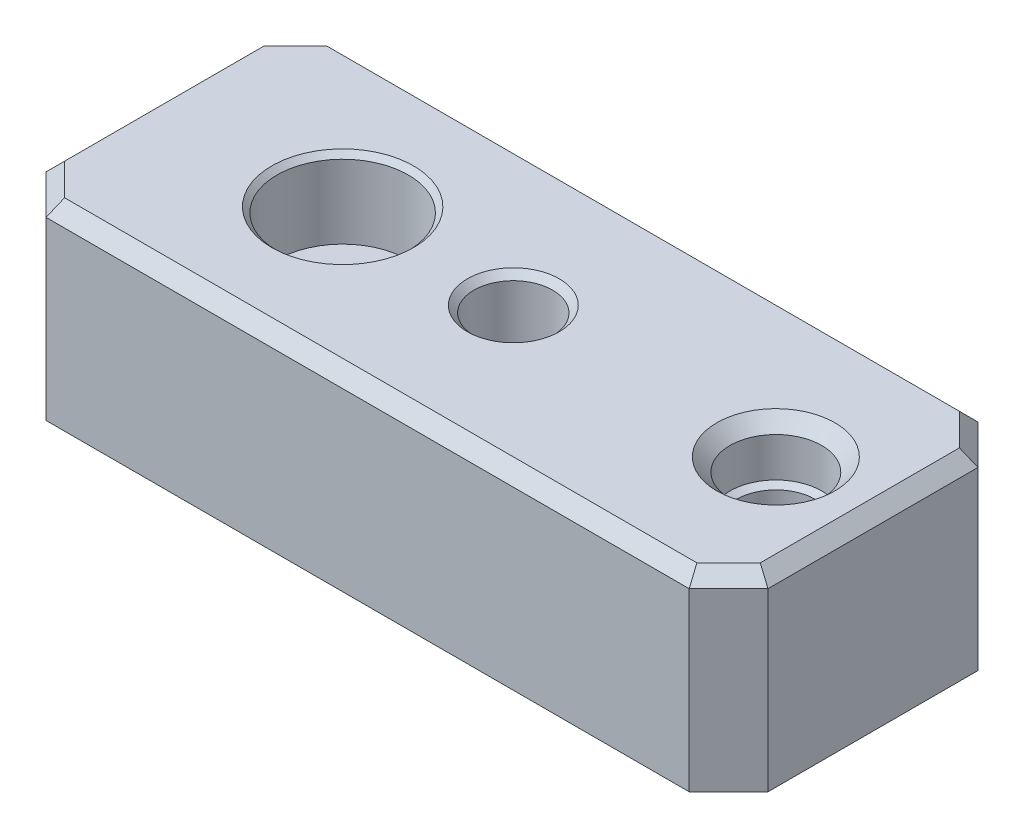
ISO-10303-21;
HEADER;
FILE_DESCRIPTION(('STEP AP214'),'2;1');
FILE_NAME('part.step','',(''),(''),'','','');
FILE_SCHEMA(('AUTOMOTIVE_DESIGN { 1 0 10303 214 1 1 1 1 }'));
ENDSEC;
DATA;
#1=APPLICATION_CONTEXT('core data for automotive mechanical design processes');
#2=APPLICATION_PROTOCOL_DEFINITION('international standard','automotive_design',2000,#1);
#3=PRODUCT_CONTEXT('',#1,'mechanical');
#4=PRODUCT('Part','Part','',(#3));
#5=PRODUCT_RELATED_PRODUCT_CATEGORY('part','',(#4));
#6=PRODUCT_DEFINITION_FORMATION('','',#4);
#7=PRODUCT_DEFINITION_CONTEXT('part definition',#1,'design');
#8=PRODUCT_DEFINITION('design','',#6,#7);
#9=PRODUCT_DEFINITION_SHAPE('','',#8);
#10=(LENGTH_UNIT() NAMED_UNIT(*) SI_UNIT(.MILLI.,.METRE.));
#11=(NAMED_UNIT(*) PLANE_ANGLE_UNIT() SI_UNIT($,.RADIAN.));
#12=(NAMED_UNIT(*) SI_UNIT($,.STERADIAN.) SOLID_ANGLE_UNIT());
#13=UNCERTAINTY_MEASURE_WITH_UNIT(LENGTH_MEASURE(1.E-05),#10,'distance_accuracy_value','');
#14=(GEOMETRIC_REPRESENTATION_CONTEXT(3) GLOBAL_UNCERTAINTY_ASSIGNED_CONTEXT((#13)) GLOBAL_UNIT_ASSIGNED_CONTEXT((#10,
#11,#12)) REPRESENTATION_CONTEXT('',''));
#15=CARTESIAN_POINT('',(0.,0.,0.));
#16=DIRECTION('',(0.,0.,1.));
#17=DIRECTION('',(1.,0.,0.));
#18=AXIS2_PLACEMENT_3D('',#15,#16,#17);
#19=CARTESIAN_POINT('',(13.8,1.7,0.));
#20=DIRECTION('',(0.,-1.,0.));
#21=DIRECTION('',(0.,0.,-1.));
#22=AXIS2_PLACEMENT_3D('',#19,#20,#21);
#23=CONICAL_SURFACE('',#22,1.25,0.785398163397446);
#24=CARTESIAN_POINT('',(13.8,1.2,0.));
#25=DIRECTION('',(0.,1.,0.));
#26=DIRECTION('',(0.,0.,1.));
#27=AXIS2_PLACEMENT_3D('',#24,#25,#26);
#28=CIRCLE('',#27,1.75);
#29=CARTESIAN_POINT('',(13.8,1.2,1.75));
#30=VERTEX_POINT('',#29);
#31=EDGE_CURVE('E204',#30,#30,#28,.T.);
#32=ORIENTED_EDGE('',*,*,#31,.F.);
#33=EDGE_LOOP('',(#32));
#34=FACE_BOUND('',#33,.T.);
#35=CARTESIAN_POINT('',(13.8,1.45,0.));
#36=DIRECTION('',(0.,-1.,0.));
#37=DIRECTION('',(0.,0.,-1.));
#38=AXIS2_PLACEMENT_3D('',#35,#36,#37);
#39=CIRCLE('',#38,1.5);
#40=CARTESIAN_POINT('',(13.8,1.45,-1.5));
#41=VERTEX_POINT('',#40);
#42=EDGE_CURVE('E374',#41,#41,#39,.T.);
#43=ORIENTED_EDGE('',*,*,#42,.F.);
#44=EDGE_LOOP('',(#43));
#45=FACE_BOUND('',#44,.T.);
#46=ADVANCED_FACE('F16',(#34,#45),#23,.F.);
#47=CARTESIAN_POINT('',(13.8,7.2,0.));
#48=DIRECTION('',(0.,1.,0.));
#49=DIRECTION('',(0.,0.,1.));
#50=AXIS2_PLACEMENT_3D('',#47,#48,#49);
#51=CONICAL_SURFACE('',#50,1.75,0.785398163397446);
#52=CARTESIAN_POINT('',(13.8,7.2,0.));
#53=DIRECTION('',(0.,1.,0.));
#54=DIRECTION('',(0.,0.,1.));
#55=AXIS2_PLACEMENT_3D('',#52,#53,#54);
#56=CIRCLE('',#55,1.75);
#57=CARTESIAN_POINT('',(13.8,7.2,1.75));
#58=VERTEX_POINT('',#57);
#59=EDGE_CURVE('E207',#58,#58,#56,.T.);
#60=ORIENTED_EDGE('',*,*,#59,.T.);
#61=EDGE_LOOP('',(#60));
#62=FACE_BOUND('',#61,.T.);
#63=CARTESIAN_POINT('',(13.8,6.95,0.));
#64=DIRECTION('',(0.,1.,0.));
#65=DIRECTION('',(0.,0.,1.));
#66=AXIS2_PLACEMENT_3D('',#63,#64,#65);
#67=CIRCLE('',#66,1.5);
#68=CARTESIAN_POINT('',(13.8,6.95,1.5));
#69=VERTEX_POINT('',#68);
#70=EDGE_CURVE('E21',#69,#69,#67,.T.);
#71=ORIENTED_EDGE('',*,*,#70,.F.);
#72=EDGE_LOOP('',(#71));
#73=FACE_BOUND('',#72,.T.);
#74=ADVANCED_FACE('F385',(#62,#73),#51,.F.);
#75=CARTESIAN_POINT('',(23.8,0.5,0.));
#76=DIRECTION('',(0.,-1.,0.));
#77=DIRECTION('',(0.,0.,-1.));
#78=AXIS2_PLACEMENT_3D('',#75,#76,#77);
#79=CONICAL_SURFACE('',#78,1.25,0.785398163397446);
#80=CARTESIAN_POINT('',(23.8,0.,0.));
#81=DIRECTION('',(0.,1.,0.));
#82=DIRECTION('',(0.,0.,1.));
#83=AXIS2_PLACEMENT_3D('',#80,#81,#82);
#84=CIRCLE('',#83,1.75);
#85=CARTESIAN_POINT('',(23.8,0.,1.75));
#86=VERTEX_POINT('',#85);
#87=EDGE_CURVE('E210',#86,#86,#84,.T.);
#88=ORIENTED_EDGE('',*,*,#87,.F.);
#89=EDGE_LOOP('',(#88));
#90=FACE_BOUND('',#89,.T.);
#91=CARTESIAN_POINT('',(23.8,0.25,0.));
#92=DIRECTION('',(0.,-1.,0.));
#93=DIRECTION('',(0.,0.,-1.));
#94=AXIS2_PLACEMENT_3D('',#91,#92,#93);
#95=CIRCLE('',#94,1.5);
#96=CARTESIAN_POINT('',(23.8,0.25,-1.5));
#97=VERTEX_POINT('',#96);
#98=EDGE_CURVE('E176',#97,#97,#95,.T.);
#99=ORIENTED_EDGE('',*,*,#98,.F.);
#100=EDGE_LOOP('',(#99));
#101=FACE_BOUND('',#100,.T.);
#102=ADVANCED_FACE('F387',(#90,#101),#79,.F.);
#103=CARTESIAN_POINT('',(23.8,5.2,0.));
#104=DIRECTION('',(0.,1.,0.));
#105=DIRECTION('',(0.,0.,1.));
#106=AXIS2_PLACEMENT_3D('',#103,#104,#105);
#107=CONICAL_SURFACE('',#106,1.75,1.02974425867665);
#108=CARTESIAN_POINT('',(23.8,5.2,0.));
#109=DIRECTION('',(0.,1.,0.));
#110=DIRECTION('',(0.,0.,1.));
#111=AXIS2_PLACEMENT_3D('',#108,#109,#110);
#112=CIRCLE('',#111,1.75);
#113=CARTESIAN_POINT('',(23.8,5.2,1.75));
#114=VERTEX_POINT('',#113);
#115=EDGE_CURVE('E201',#114,#114,#112,.T.);
#116=ORIENTED_EDGE('',*,*,#115,.T.);
#117=EDGE_LOOP('',(#116));
#118=FACE_BOUND('',#117,.T.);
#119=CARTESIAN_POINT('',(23.8,5.04978484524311,0.));
#120=DIRECTION('',(0.,1.,0.));
#121=DIRECTION('',(0.,0.,1.));
#122=AXIS2_PLACEMENT_3D('',#119,#120,#121);
#123=CIRCLE('',#122,1.5);
#124=CARTESIAN_POINT('',(23.8,5.04978484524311,1.5));
#125=VERTEX_POINT('',#124);
#126=EDGE_CURVE('E179',#125,#125,#123,.T.);
#127=ORIENTED_EDGE('',*,*,#126,.F.);
#128=EDGE_LOOP('',(#127));
#129=FACE_BOUND('',#128,.T.);
#130=ADVANCED_FACE('F396',(#118,#129),#107,.F.);
#131=CARTESIAN_POINT('',(0.,7.2,-5.5));
#132=DIRECTION('',(1.,0.,0.));
#133=DIRECTION('',(0.,0.,-1.));
#134=AXIS2_PLACEMENT_3D('',#131,#132,#133);
#135=PLANE('',#134);
#136=DIRECTION('',(0.,1.,0.));
#137=VECTOR('',#136,1.);
#138=CARTESIAN_POINT('',(0.,7.2,4.));
#139=LINE('',#138,#137);
#140=CARTESIAN_POINT('',(0.,0.,4.));
#141=VERTEX_POINT('',#140);
#142=CARTESIAN_POINT('',(0.,6.7,4.));
#143=VERTEX_POINT('',#142);
#144=EDGE_CURVE('E306',#141,#143,#139,.T.);
#145=ORIENTED_EDGE('',*,*,#144,.T.);
#146=DIRECTION('',(0.,0.,-1.));
#147=VECTOR('',#146,1.);
#148=CARTESIAN_POINT('',(0.,6.7,-4.));
#149=LINE('',#148,#147);
#150=CARTESIAN_POINT('',(0.,6.7,-4.));
#151=VERTEX_POINT('',#150);
#152=EDGE_CURVE('E341',#143,#151,#149,.T.);
#153=ORIENTED_EDGE('',*,*,#152,.T.);
#154=DIRECTION('',(0.,-1.,0.));
#155=VECTOR('',#154,1.);
#156=CARTESIAN_POINT('',(0.,7.2,-4.));
#157=LINE('',#156,#155);
#158=CARTESIAN_POINT('',(0.,0.,-4.));
#159=VERTEX_POINT('',#158);
#160=EDGE_CURVE('E309',#151,#159,#157,.T.);
#161=ORIENTED_EDGE('',*,*,#160,.T.);
#162=DIRECTION('',(0.,0.,1.));
#163=VECTOR('',#162,1.);
#164=CARTESIAN_POINT('',(0.,0.,-5.5));
#165=LINE('',#164,#163);
#166=CARTESIAN_POINT('',(0.,0.,-3.25));
#167=VERTEX_POINT('',#166);
#168=EDGE_CURVE('E272',#159,#167,#165,.T.);
#169=ORIENTED_EDGE('',*,*,#168,.T.);
#170=DIRECTION('',(0.,-1.,0.));
#171=VECTOR('',#170,1.);
#172=CARTESIAN_POINT('',(0.,1.2,-3.25));
#173=LINE('',#172,#171);
#174=CARTESIAN_POINT('',(0.,1.2,-3.25));
#175=VERTEX_POINT('',#174);
#176=EDGE_CURVE('E254',#175,#167,#173,.T.);
#177=ORIENTED_EDGE('',*,*,#176,.F.);
#178=DIRECTION('',(0.,0.,-1.));
#179=VECTOR('',#178,1.);
#180=CARTESIAN_POINT('',(0.,1.2,3.25));
#181=LINE('',#180,#179);
#182=CARTESIAN_POINT('',(0.,1.2,3.25));
#183=VERTEX_POINT('',#182);
#184=EDGE_CURVE('E241',#183,#175,#181,.T.);
#185=ORIENTED_EDGE('',*,*,#184,.F.);
#186=DIRECTION('',(0.,-1.,0.));
#187=VECTOR('',#186,1.);
#188=CARTESIAN_POINT('',(0.,1.2,3.25));
#189=LINE('',#188,#187);
#190=CARTESIAN_POINT('',(0.,0.,3.25));
#191=VERTEX_POINT('',#190);
#192=EDGE_CURVE('E262',#183,#191,#189,.T.);
#193=ORIENTED_EDGE('',*,*,#192,.T.);
#194=EDGE_CURVE('E265',#191,#141,#165,.T.);
#195=ORIENTED_EDGE('',*,*,#194,.T.);
#196=EDGE_LOOP('',(#145,#153,#161,#169,#177,#185,#193,#195));
#197=FACE_BOUND('',#196,.T.);
#198=ADVANCED_FACE('F472',(#197),#135,.F.);
#199=CARTESIAN_POINT('',(0.,7.2,5.5));
#200=DIRECTION('',(0.,0.,-1.));
#201=DIRECTION('',(-1.,0.,0.));
#202=AXIS2_PLACEMENT_3D('',#199,#200,#201);
#203=PLANE('',#202);
#204=DIRECTION('',(0.,1.,0.));
#205=VECTOR('',#204,1.);
#206=CARTESIAN_POINT('',(26.,7.2,5.5));
#207=LINE('',#206,#205);
#208=CARTESIAN_POINT('',(26.,0.,5.5));
#209=VERTEX_POINT('',#208);
#210=CARTESIAN_POINT('',(26.,6.7,5.5));
#211=VERTEX_POINT('',#210);
#212=EDGE_CURVE('E304',#209,#211,#207,.T.);
#213=ORIENTED_EDGE('',*,*,#212,.T.);
#214=DIRECTION('',(-1.,0.,0.));
#215=VECTOR('',#214,1.);
#216=CARTESIAN_POINT('',(1.5,6.7,5.5));
#217=LINE('',#216,#215);
#218=CARTESIAN_POINT('',(1.5,6.7,5.5));
#219=VERTEX_POINT('',#218);
#220=EDGE_CURVE('E42',#211,#219,#217,.T.);
#221=ORIENTED_EDGE('',*,*,#220,.T.);
#222=DIRECTION('',(0.,-1.,0.));
#223=VECTOR('',#222,1.);
#224=CARTESIAN_POINT('',(1.5,7.2,5.5));
#225=LINE('',#224,#223);
#226=CARTESIAN_POINT('',(1.5,0.,5.5));
#227=VERTEX_POINT('',#226);
#228=EDGE_CURVE('E302',#219,#227,#225,.T.);
#229=ORIENTED_EDGE('',*,*,#228,.T.);
#230=DIRECTION('',(1.,0.,0.));
#231=VECTOR('',#230,1.);
#232=CARTESIAN_POINT('',(0.,0.,5.5));
#233=LINE('',#232,#231);
#234=EDGE_CURVE('E274',#227,#209,#233,.T.);
#235=ORIENTED_EDGE('',*,*,#234,.T.);
#236=EDGE_LOOP('',(#213,#221,#229,#235));
#237=FACE_BOUND('',#236,.T.);
#238=ADVANCED_FACE('F468',(#237),#203,.F.);
#239=CARTESIAN_POINT('',(27.5,7.2,-5.5));
#240=DIRECTION('',(-1.,0.,0.));
#241=DIRECTION('',(0.,0.,1.));
#242=AXIS2_PLACEMENT_3D('',#239,#240,#241);
#243=PLANE('',#242);
#244=DIRECTION('',(0.,1.,0.));
#245=VECTOR('',#244,1.);
#246=CARTESIAN_POINT('',(27.5,7.2,-4.));
#247=LINE('',#246,#245);
#248=CARTESIAN_POINT('',(27.5,0.,-4.));
#249=VERTEX_POINT('',#248);
#250=CARTESIAN_POINT('',(27.5,6.7,-4.));
#251=VERTEX_POINT('',#250);
#252=EDGE_CURVE('E299',#249,#251,#247,.T.);
#253=ORIENTED_EDGE('',*,*,#252,.T.);
#254=DIRECTION('',(0.,0.,1.));
#255=VECTOR('',#254,1.);
#256=CARTESIAN_POINT('',(27.5,6.7,4.));
#257=LINE('',#256,#255);
#258=CARTESIAN_POINT('',(27.5,6.7,4.));
#259=VERTEX_POINT('',#258);
#260=EDGE_CURVE('E332',#251,#259,#257,.T.);
#261=ORIENTED_EDGE('',*,*,#260,.T.);
#262=DIRECTION('',(0.,-1.,0.));
#263=VECTOR('',#262,1.);
#264=CARTESIAN_POINT('',(27.5,7.2,4.));
#265=LINE('',#264,#263);
#266=CARTESIAN_POINT('',(27.5,0.,4.));
#267=VERTEX_POINT('',#266);
#268=EDGE_CURVE('E297',#259,#267,#265,.T.);
#269=ORIENTED_EDGE('',*,*,#268,.T.);
#270=DIRECTION('',(0.,0.,-1.));
#271=VECTOR('',#270,1.);
#272=CARTESIAN_POINT('',(27.5,0.,-5.5));
#273=LINE('',#272,#271);
#274=EDGE_CURVE('E277',#267,#249,#273,.T.);
#275=ORIENTED_EDGE('',*,*,#274,.T.);
#276=EDGE_LOOP('',(#253,#261,#269,#275));
#277=FACE_BOUND('',#276,.T.);
#278=ADVANCED_FACE('F464',(#277),#243,.F.);
#279=CARTESIAN_POINT('',(0.,7.2,-5.5));
#280=DIRECTION('',(0.,0.,1.));
#281=DIRECTION('',(1.,0.,0.));
#282=AXIS2_PLACEMENT_3D('',#279,#280,#281);
#283=PLANE('',#282);
#284=DIRECTION('',(0.,1.,0.));
#285=VECTOR('',#284,1.);
#286=CARTESIAN_POINT('',(1.5,7.2,-5.5));
#287=LINE('',#286,#285);
#288=CARTESIAN_POINT('',(1.5,0.,-5.5));
#289=VERTEX_POINT('',#288);
#290=CARTESIAN_POINT('',(1.5,6.7,-5.5));
#291=VERTEX_POINT('',#290);
#292=EDGE_CURVE('E284',#289,#291,#287,.T.);
#293=ORIENTED_EDGE('',*,*,#292,.T.);
#294=DIRECTION('',(1.,0.,0.));
#295=VECTOR('',#294,1.);
#296=CARTESIAN_POINT('',(26.,6.7,-5.5));
#297=LINE('',#296,#295);
#298=CARTESIAN_POINT('',(26.,6.7,-5.5));
#299=VERTEX_POINT('',#298);
#300=EDGE_CURVE('E336',#291,#299,#297,.T.);
#301=ORIENTED_EDGE('',*,*,#300,.T.);
#302=DIRECTION('',(0.,-1.,0.));
#303=VECTOR('',#302,1.);
#304=CARTESIAN_POINT('',(26.,7.2,-5.5));
#305=LINE('',#304,#303);
#306=CARTESIAN_POINT('',(26.,0.,-5.5));
#307=VERTEX_POINT('',#306);
#308=EDGE_CURVE('E287',#299,#307,#305,.T.);
#309=ORIENTED_EDGE('',*,*,#308,.T.);
#310=DIRECTION('',(-1.,0.,0.));
#311=VECTOR('',#310,1.);
#312=CARTESIAN_POINT('',(0.,0.,-5.5));
#313=LINE('',#312,#311);
#314=EDGE_CURVE('E280',#307,#289,#313,.T.);
#315=ORIENTED_EDGE('',*,*,#314,.T.);
#316=EDGE_LOOP('',(#293,#301,#309,#315));
#317=FACE_BOUND('',#316,.T.);
#318=ADVANCED_FACE('F457',(#317),#283,.F.);
#319=CARTESIAN_POINT('',(0.,7.2,0.));
#320=DIRECTION('',(0.,1.,0.));
#321=DIRECTION('',(0.,0.,1.));
#322=AXIS2_PLACEMENT_3D('',#319,#320,#321);
#323=PLANE('',#322);
#324=DIRECTION('',(0.,0.,-1.));
#325=VECTOR('',#324,1.);
#326=CARTESIAN_POINT('',(27.,7.2,-4.));
#327=LINE('',#326,#325);
#328=CARTESIAN_POINT('',(27.,7.2,3.79289321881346));
#329=VERTEX_POINT('',#328);
#330=CARTESIAN_POINT('',(27.,7.2,-3.79289321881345));
#331=VERTEX_POINT('',#330);
#332=EDGE_CURVE('E324',#329,#331,#327,.T.);
#333=ORIENTED_EDGE('',*,*,#332,.T.);
#334=DIRECTION('',(-0.707106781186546,0.,-0.707106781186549));
#335=VECTOR('',#334,1.);
#336=CARTESIAN_POINT('',(15.3964466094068,7.2,-15.3964466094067));
#337=LINE('',#336,#335);
#338=CARTESIAN_POINT('',(25.7928932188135,7.2,-5.));
#339=VERTEX_POINT('',#338);
#340=EDGE_CURVE('E326',#331,#339,#337,.T.);
#341=ORIENTED_EDGE('',*,*,#340,.T.);
#342=DIRECTION('',(-1.,0.,0.));
#343=VECTOR('',#342,1.);
#344=CARTESIAN_POINT('',(1.5,7.2,-5.));
#345=LINE('',#344,#343);
#346=CARTESIAN_POINT('',(1.70710678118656,7.2,-5.));
#347=VERTEX_POINT('',#346);
#348=EDGE_CURVE('E319',#339,#347,#345,.T.);
#349=ORIENTED_EDGE('',*,*,#348,.T.);
#350=DIRECTION('',(-0.707106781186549,0.,0.707106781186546));
#351=VECTOR('',#350,1.);
#352=CARTESIAN_POINT('',(-1.64644660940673,7.2,-1.64644660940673));
#353=LINE('',#352,#351);
#354=CARTESIAN_POINT('',(0.5,7.2,-3.79289321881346));
#355=VERTEX_POINT('',#354);
#356=EDGE_CURVE('E317',#347,#355,#353,.T.);
#357=ORIENTED_EDGE('',*,*,#356,.T.);
#358=DIRECTION('',(0.,0.,1.));
#359=VECTOR('',#358,1.);
#360=CARTESIAN_POINT('',(0.5,7.2,4.));
#361=LINE('',#360,#359);
#362=CARTESIAN_POINT('',(0.5,7.2,3.79289321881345));
#363=VERTEX_POINT('',#362);
#364=EDGE_CURVE('E315',#355,#363,#361,.T.);
#365=ORIENTED_EDGE('',*,*,#364,.T.);
#366=DIRECTION('',(0.707106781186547,0.,0.707106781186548));
#367=VECTOR('',#366,1.);
#368=CARTESIAN_POINT('',(-1.64644660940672,7.2,1.64644660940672));
#369=LINE('',#368,#367);
#370=CARTESIAN_POINT('',(1.70710678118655,7.2,5.));
#371=VERTEX_POINT('',#370);
#372=EDGE_CURVE('E313',#363,#371,#369,.T.);
#373=ORIENTED_EDGE('',*,*,#372,.T.);
#374=DIRECTION('',(1.,0.,0.));
#375=VECTOR('',#374,1.);
#376=CARTESIAN_POINT('',(26.,7.2,5.));
#377=LINE('',#376,#375);
#378=CARTESIAN_POINT('',(25.7928932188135,7.2,5.));
#379=VERTEX_POINT('',#378);
#380=EDGE_CURVE('E311',#371,#379,#377,.T.);
#381=ORIENTED_EDGE('',*,*,#380,.T.);
#382=DIRECTION('',(0.707106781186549,0.,-0.707106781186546));
#383=VECTOR('',#382,1.);
#384=CARTESIAN_POINT('',(15.3964466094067,7.2,15.3964466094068));
#385=LINE('',#384,#383);
#386=EDGE_CURVE('E322',#379,#329,#385,.T.);
#387=ORIENTED_EDGE('',*,*,#386,.T.);
#388=EDGE_LOOP('',(#333,#341,#349,#357,#365,#373,#381,#387));
#389=FACE_BOUND('',#388,.T.);
#390=CARTESIAN_POINT('',(23.8,7.2,0.));
#391=DIRECTION('',(0.,1.,0.));
#392=DIRECTION('',(0.,0.,1.));
#393=AXIS2_PLACEMENT_3D('',#390,#391,#392);
#394=CIRCLE('',#393,2.25);
#395=CARTESIAN_POINT('',(23.8,7.2,2.25));
#396=VERTEX_POINT('',#395);
#397=EDGE_CURVE('E194',#396,#396,#394,.T.);
#398=ORIENTED_EDGE('',*,*,#397,.F.);
#399=EDGE_LOOP('',(#398));
#400=FACE_BOUND('',#399,.T.);
#401=ORIENTED_EDGE('',*,*,#59,.F.);
#402=EDGE_LOOP('',(#401));
#403=FACE_BOUND('',#402,.T.);
#404=CARTESIAN_POINT('',(7.3,7.2,0.));
#405=DIRECTION('',(0.,1.,0.));
#406=DIRECTION('',(0.,0.,1.));
#407=AXIS2_PLACEMENT_3D('',#404,#405,#406);
#408=CIRCLE('',#407,2.7);
#409=CARTESIAN_POINT('',(7.3,7.2,2.7));
#410=VERTEX_POINT('',#409);
#411=EDGE_CURVE('E216',#410,#410,#408,.T.);
#412=ORIENTED_EDGE('',*,*,#411,.F.);
#413=EDGE_LOOP('',(#412));
#414=FACE_BOUND('',#413,.T.);
#415=ADVANCED_FACE('F454',(#389,#400,#403,#414),#323,.T.);
#416=CARTESIAN_POINT('',(0.,0.,0.));
#417=DIRECTION('',(0.,1.,0.));
#418=DIRECTION('',(0.,0.,1.));
#419=AXIS2_PLACEMENT_3D('',#416,#417,#418);
#420=PLANE('',#419);
#421=ORIENTED_EDGE('',*,*,#87,.T.);
#422=EDGE_LOOP('',(#421));
#423=FACE_BOUND('',#422,.T.);
#424=ORIENTED_EDGE('',*,*,#314,.F.);
#425=DIRECTION('',(-0.707106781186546,0.,-0.707106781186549));
#426=VECTOR('',#425,1.);
#427=CARTESIAN_POINT('',(26.,0.,-5.5));
#428=LINE('',#427,#426);
#429=EDGE_CURVE('E295',#307,#249,#428,.F.);
#430=ORIENTED_EDGE('',*,*,#429,.T.);
#431=ORIENTED_EDGE('',*,*,#274,.F.);
#432=DIRECTION('',(0.707106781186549,0.,-0.707106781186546));
#433=VECTOR('',#432,1.);
#434=CARTESIAN_POINT('',(27.5,0.,4.));
#435=LINE('',#434,#433);
#436=EDGE_CURVE('E293',#267,#209,#435,.F.);
#437=ORIENTED_EDGE('',*,*,#436,.T.);
#438=ORIENTED_EDGE('',*,*,#234,.F.);
#439=DIRECTION('',(0.707106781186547,0.,0.707106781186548));
#440=VECTOR('',#439,1.);
#441=CARTESIAN_POINT('',(1.5,0.,5.5));
#442=LINE('',#441,#440);
#443=EDGE_CURVE('E289',#227,#141,#442,.F.);
#444=ORIENTED_EDGE('',*,*,#443,.T.);
#445=ORIENTED_EDGE('',*,*,#194,.F.);
#446=DIRECTION('',(-1.,0.,0.));
#447=VECTOR('',#446,1.);
#448=CARTESIAN_POINT('',(0.,0.,3.25));
#449=LINE('',#448,#447);
#450=CARTESIAN_POINT('',(13.8,0.,3.25));
#451=VERTEX_POINT('',#450);
#452=EDGE_CURVE('E245',#451,#191,#449,.T.);
#453=ORIENTED_EDGE('',*,*,#452,.F.);
#454=CARTESIAN_POINT('',(13.8,0.,0.));
#455=DIRECTION('',(0.,-1.,0.));
#456=DIRECTION('',(0.,0.,-1.));
#457=AXIS2_PLACEMENT_3D('',#454,#455,#456);
#458=CIRCLE('',#457,3.25);
#459=CARTESIAN_POINT('',(13.8,0.,-3.25));
#460=VERTEX_POINT('',#459);
#461=EDGE_CURVE('E257',#460,#451,#458,.T.);
#462=ORIENTED_EDGE('',*,*,#461,.F.);
#463=DIRECTION('',(1.,0.,0.));
#464=VECTOR('',#463,1.);
#465=CARTESIAN_POINT('',(0.,0.,-3.25));
#466=LINE('',#465,#464);
#467=EDGE_CURVE('E240',#167,#460,#466,.T.);
#468=ORIENTED_EDGE('',*,*,#467,.F.);
#469=ORIENTED_EDGE('',*,*,#168,.F.);
#470=DIRECTION('',(-0.707106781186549,0.,0.707106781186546));
#471=VECTOR('',#470,1.);
#472=CARTESIAN_POINT('',(0.,0.,-4.));
#473=LINE('',#472,#471);
#474=EDGE_CURVE('E291',#159,#289,#473,.F.);
#475=ORIENTED_EDGE('',*,*,#474,.T.);
#476=EDGE_LOOP('',(#424,#430,#431,#437,#438,#444,#445,#453,#462,#468,#469,#475));
#477=FACE_BOUND('',#476,.T.);
#478=ADVANCED_FACE('F446',(#423,#477),#420,.F.);
#479=CARTESIAN_POINT('',(0.,1.2,3.25));
#480=DIRECTION('',(0.,0.,1.));
#481=DIRECTION('',(1.,0.,0.));
#482=AXIS2_PLACEMENT_3D('',#479,#480,#481);
#483=PLANE('',#482);
#484=ORIENTED_EDGE('',*,*,#452,.T.);
#485=ORIENTED_EDGE('',*,*,#192,.F.);
#486=DIRECTION('',(-1.,0.,0.));
#487=VECTOR('',#486,1.);
#488=CARTESIAN_POINT('',(0.,1.2,3.25));
#489=LINE('',#488,#487);
#490=CARTESIAN_POINT('',(13.8,1.2,3.25));
#491=VERTEX_POINT('',#490);
#492=EDGE_CURVE('E251',#491,#183,#489,.T.);
#493=ORIENTED_EDGE('',*,*,#492,.F.);
#494=DIRECTION('',(0.,-1.,0.));
#495=VECTOR('',#494,1.);
#496=CARTESIAN_POINT('',(13.8,1.2,3.25));
#497=LINE('',#496,#495);
#498=EDGE_CURVE('E266',#491,#451,#497,.T.);
#499=ORIENTED_EDGE('',*,*,#498,.T.);
#500=EDGE_LOOP('',(#484,#485,#493,#499));
#501=FACE_BOUND('',#500,.T.);
#502=ADVANCED_FACE('F442',(#501),#483,.F.);
#503=CARTESIAN_POINT('',(13.8,1.2,0.));
#504=DIRECTION('',(0.,-1.,0.));
#505=DIRECTION('',(0.,0.,-1.));
#506=AXIS2_PLACEMENT_3D('',#503,#504,#505);
#507=CYLINDRICAL_SURFACE('',#506,3.25);
#508=ORIENTED_EDGE('',*,*,#461,.T.);
#509=ORIENTED_EDGE('',*,*,#498,.F.);
#510=CARTESIAN_POINT('',(13.8,1.2,0.));
#511=DIRECTION('',(0.,-1.,0.));
#512=DIRECTION('',(0.,0.,-1.));
#513=AXIS2_PLACEMENT_3D('',#510,#511,#512);
#514=CIRCLE('',#513,3.25);
#515=CARTESIAN_POINT('',(13.8,1.2,-3.25));
#516=VERTEX_POINT('',#515);
#517=EDGE_CURVE('E248',#516,#491,#514,.T.);
#518=ORIENTED_EDGE('',*,*,#517,.F.);
#519=DIRECTION('',(0.,-1.,0.));
#520=VECTOR('',#519,1.);
#521=CARTESIAN_POINT('',(13.8,1.2,-3.25));
#522=LINE('',#521,#520);
#523=EDGE_CURVE('E268',#516,#460,#522,.T.);
#524=ORIENTED_EDGE('',*,*,#523,.T.);
#525=EDGE_LOOP('',(#508,#509,#518,#524));
#526=FACE_BOUND('',#525,.T.);
#527=ADVANCED_FACE('F445',(#526),#507,.F.);
#528=CARTESIAN_POINT('',(0.,1.2,-3.25));
#529=DIRECTION('',(0.,0.,-1.));
#530=DIRECTION('',(-1.,0.,0.));
#531=AXIS2_PLACEMENT_3D('',#528,#529,#530);
#532=PLANE('',#531);
#533=ORIENTED_EDGE('',*,*,#467,.T.);
#534=ORIENTED_EDGE('',*,*,#523,.F.);
#535=DIRECTION('',(1.,0.,0.));
#536=VECTOR('',#535,1.);
#537=CARTESIAN_POINT('',(0.,1.2,-3.25));
#538=LINE('',#537,#536);
#539=EDGE_CURVE('E244',#175,#516,#538,.T.);
#540=ORIENTED_EDGE('',*,*,#539,.F.);
#541=ORIENTED_EDGE('',*,*,#176,.T.);
#542=EDGE_LOOP('',(#533,#534,#540,#541));
#543=FACE_BOUND('',#542,.T.);
#544=ADVANCED_FACE('F440',(#543),#532,.F.);
#545=CARTESIAN_POINT('',(13.8,1.2,0.));
#546=DIRECTION('',(0.,-1.,0.));
#547=DIRECTION('',(0.,0.,-1.));
#548=AXIS2_PLACEMENT_3D('',#545,#546,#547);
#549=PLANE('',#548);
#550=ORIENTED_EDGE('',*,*,#31,.T.);
#551=EDGE_LOOP('',(#550));
#552=FACE_BOUND('',#551,.T.);
#553=CARTESIAN_POINT('',(7.3,1.2,0.));
#554=DIRECTION('',(0.,1.,0.));
#555=DIRECTION('',(0.,0.,1.));
#556=AXIS2_PLACEMENT_3D('',#553,#554,#555);
#557=CIRCLE('',#556,1.7);
#558=CARTESIAN_POINT('',(7.3,1.2,1.7));
#559=VERTEX_POINT('',#558);
#560=EDGE_CURVE('E213',#559,#559,#557,.T.);
#561=ORIENTED_EDGE('',*,*,#560,.T.);
#562=EDGE_LOOP('',(#561));
#563=FACE_BOUND('',#562,.T.);
#564=CARTESIAN_POINT('',(2.3,1.2,0.));
#565=DIRECTION('',(0.,-1.,0.));
#566=DIRECTION('',(0.,0.,-1.));
#567=AXIS2_PLACEMENT_3D('',#564,#565,#566);
#568=CIRCLE('',#567,1.7);
#569=CARTESIAN_POINT('',(2.3,1.2,-1.7));
#570=VERTEX_POINT('',#569);
#571=EDGE_CURVE('E231',#570,#570,#568,.T.);
#572=ORIENTED_EDGE('',*,*,#571,.F.);
#573=EDGE_LOOP('',(#572));
#574=FACE_BOUND('',#573,.T.);
#575=ORIENTED_EDGE('',*,*,#184,.T.);
#576=ORIENTED_EDGE('',*,*,#539,.T.);
#577=ORIENTED_EDGE('',*,*,#517,.T.);
#578=ORIENTED_EDGE('',*,*,#492,.T.);
#579=EDGE_LOOP('',(#575,#576,#577,#578));
#580=FACE_BOUND('',#579,.T.);
#581=ADVANCED_FACE('F436',(#552,#563,#574,#580),#549,.T.);
#582=CARTESIAN_POINT('',(2.3,1.7,0.));
#583=DIRECTION('',(0.,1.,0.));
#584=DIRECTION('',(0.,0.,1.));
#585=AXIS2_PLACEMENT_3D('',#582,#583,#584);
#586=PLANE('',#585);
#587=DIRECTION('',(0.,0.,-1.));
#588=VECTOR('',#587,1.);
#589=CARTESIAN_POINT('',(3.3,1.7,0.));
#590=LINE('',#589,#588);
#591=CARTESIAN_POINT('',(3.3,1.7,0.25));
#592=VERTEX_POINT('',#591);
#593=CARTESIAN_POINT('',(3.3,1.7,-0.25));
#594=VERTEX_POINT('',#593);
#595=EDGE_CURVE('E346',#592,#594,#590,.T.);
#596=ORIENTED_EDGE('',*,*,#595,.T.);
#597=CARTESIAN_POINT('',(2.3,1.7,-0.25));
#598=DIRECTION('',(0.,1.,0.));
#599=DIRECTION('',(0.,0.,1.));
#600=AXIS2_PLACEMENT_3D('',#597,#598,#599);
#601=CIRCLE('',#600,1.);
#602=CARTESIAN_POINT('',(1.3,1.7,-0.25));
#603=VERTEX_POINT('',#602);
#604=EDGE_CURVE('E10',#594,#603,#601,.T.);
#605=ORIENTED_EDGE('',*,*,#604,.T.);
#606=DIRECTION('',(0.,0.,1.));
#607=VECTOR('',#606,1.);
#608=CARTESIAN_POINT('',(1.3,1.7,0.));
#609=LINE('',#608,#607);
#610=CARTESIAN_POINT('',(1.3,1.7,0.25));
#611=VERTEX_POINT('',#610);
#612=EDGE_CURVE('E26',#603,#611,#609,.T.);
#613=ORIENTED_EDGE('',*,*,#612,.T.);
#614=CARTESIAN_POINT('',(2.3,1.7,0.25));
#615=DIRECTION('',(0.,1.,0.));
#616=DIRECTION('',(0.,0.,1.));
#617=AXIS2_PLACEMENT_3D('',#614,#615,#616);
#618=CIRCLE('',#617,1.);
#619=EDGE_CURVE('E368',#611,#592,#618,.T.);
#620=ORIENTED_EDGE('',*,*,#619,.T.);
#621=EDGE_LOOP('',(#596,#605,#613,#620));
#622=FACE_BOUND('',#621,.T.);
#623=CARTESIAN_POINT('',(2.3,1.7,0.));
#624=DIRECTION('',(0.,-1.,0.));
#625=DIRECTION('',(0.,0.,-1.));
#626=AXIS2_PLACEMENT_3D('',#623,#624,#625);
#627=CIRCLE('',#626,1.5);
#628=CARTESIAN_POINT('',(2.3,1.7,-1.5));
#629=VERTEX_POINT('',#628);
#630=EDGE_CURVE('E237',#629,#629,#627,.T.);
#631=ORIENTED_EDGE('',*,*,#630,.T.);
#632=EDGE_LOOP('',(#631));
#633=FACE_BOUND('',#632,.T.);
#634=ADVANCED_FACE('F432',(#622,#633),#586,.F.);
#635=CARTESIAN_POINT('',(2.3,1.2,0.));
#636=DIRECTION('',(0.,-1.,0.));
#637=DIRECTION('',(0.,0.,-1.));
#638=AXIS2_PLACEMENT_3D('',#635,#636,#637);
#639=CYLINDRICAL_SURFACE('',#638,1.5);
#640=ORIENTED_EDGE('',*,*,#630,.F.);
#641=EDGE_LOOP('',(#640));
#642=FACE_BOUND('',#641,.T.);
#643=CARTESIAN_POINT('',(2.3,1.4,0.));
#644=DIRECTION('',(0.,-1.,0.));
#645=DIRECTION('',(0.,0.,-1.));
#646=AXIS2_PLACEMENT_3D('',#643,#644,#645);
#647=CIRCLE('',#646,1.5);
#648=CARTESIAN_POINT('',(2.3,1.4,-1.5));
#649=VERTEX_POINT('',#648);
#650=EDGE_CURVE('E234',#649,#649,#647,.T.);
#651=ORIENTED_EDGE('',*,*,#650,.T.);
#652=EDGE_LOOP('',(#651));
#653=FACE_BOUND('',#652,.T.);
#654=ADVANCED_FACE('F428',(#642,#653),#639,.F.);
#655=CARTESIAN_POINT('',(2.3,1.2,0.));
#656=DIRECTION('',(0.,-1.,0.));
#657=DIRECTION('',(0.,0.,-1.));
#658=AXIS2_PLACEMENT_3D('',#655,#656,#657);
#659=CONICAL_SURFACE('',#658,1.7,0.785398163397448);
#660=ORIENTED_EDGE('',*,*,#650,.F.);
#661=EDGE_LOOP('',(#660));
#662=FACE_BOUND('',#661,.T.);
#663=ORIENTED_EDGE('',*,*,#571,.T.);
#664=EDGE_LOOP('',(#663));
#665=FACE_BOUND('',#664,.T.);
#666=ADVANCED_FACE('F424',(#662,#665),#659,.F.);
#667=CARTESIAN_POINT('',(7.3,1.45,0.));
#668=DIRECTION('',(0.,-1.,0.));
#669=DIRECTION('',(0.,0.,-1.));
#670=AXIS2_PLACEMENT_3D('',#667,#668,#669);
#671=CONICAL_SURFACE('',#670,1.45,0.78539816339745);
#672=ORIENTED_EDGE('',*,*,#560,.F.);
#673=EDGE_LOOP('',(#672));
#674=FACE_BOUND('',#673,.T.);
#675=CARTESIAN_POINT('',(7.3,1.45,0.));
#676=DIRECTION('',(0.,1.,0.));
#677=DIRECTION('',(0.,0.,1.));
#678=AXIS2_PLACEMENT_3D('',#675,#676,#677);
#679=CIRCLE('',#678,1.45);
#680=CARTESIAN_POINT('',(7.3,1.45,1.45));
#681=VERTEX_POINT('',#680);
#682=EDGE_CURVE('E228',#681,#681,#679,.T.);
#683=ORIENTED_EDGE('',*,*,#682,.T.);
#684=EDGE_LOOP('',(#683));
#685=FACE_BOUND('',#684,.T.);
#686=ADVANCED_FACE('F420',(#674,#685),#671,.F.);
#687=CARTESIAN_POINT('',(7.3,7.2,0.));
#688=DIRECTION('',(0.,1.,0.));
#689=DIRECTION('',(0.,0.,1.));
#690=AXIS2_PLACEMENT_3D('',#687,#688,#689);
#691=CYLINDRICAL_SURFACE('',#690,1.45);
#692=ORIENTED_EDGE('',*,*,#682,.F.);
#693=EDGE_LOOP('',(#692));
#694=FACE_BOUND('',#693,.T.);
#695=CARTESIAN_POINT('',(7.3,4.2,0.));
#696=DIRECTION('',(0.,1.,0.));
#697=DIRECTION('',(0.,0.,1.));
#698=AXIS2_PLACEMENT_3D('',#695,#696,#697);
#699=CIRCLE('',#698,1.45);
#700=CARTESIAN_POINT('',(7.3,4.2,1.45));
#701=VERTEX_POINT('',#700);
#702=EDGE_CURVE('E225',#701,#701,#699,.T.);
#703=ORIENTED_EDGE('',*,*,#702,.T.);
#704=EDGE_LOOP('',(#703));
#705=FACE_BOUND('',#704,.T.);
#706=ADVANCED_FACE('F416',(#694,#705),#691,.F.);
#707=CARTESIAN_POINT('',(9.8,4.2,0.));
#708=DIRECTION('',(0.,-1.,0.));
#709=DIRECTION('',(0.,0.,-1.));
#710=AXIS2_PLACEMENT_3D('',#707,#708,#709);
#711=PLANE('',#710);
#712=ORIENTED_EDGE('',*,*,#702,.F.);
#713=EDGE_LOOP('',(#712));
#714=FACE_BOUND('',#713,.T.);
#715=CARTESIAN_POINT('',(7.3,4.2,0.));
#716=DIRECTION('',(0.,1.,0.));
#717=DIRECTION('',(0.,0.,1.));
#718=AXIS2_PLACEMENT_3D('',#715,#716,#717);
#719=CIRCLE('',#718,2.5);
#720=CARTESIAN_POINT('',(7.3,4.2,2.5));
#721=VERTEX_POINT('',#720);
#722=EDGE_CURVE('E222',#721,#721,#719,.T.);
#723=ORIENTED_EDGE('',*,*,#722,.T.);
#724=EDGE_LOOP('',(#723));
#725=FACE_BOUND('',#724,.T.);
#726=ADVANCED_FACE('F412',(#714,#725),#711,.F.);
#727=CARTESIAN_POINT('',(7.3,7.2,0.));
#728=DIRECTION('',(0.,1.,0.));
#729=DIRECTION('',(0.,0.,1.));
#730=AXIS2_PLACEMENT_3D('',#727,#728,#729);
#731=CYLINDRICAL_SURFACE('',#730,2.5);
#732=ORIENTED_EDGE('',*,*,#722,.F.);
#733=EDGE_LOOP('',(#732));
#734=FACE_BOUND('',#733,.T.);
#735=CARTESIAN_POINT('',(7.3,7.,0.));
#736=DIRECTION('',(0.,1.,0.));
#737=DIRECTION('',(0.,0.,1.));
#738=AXIS2_PLACEMENT_3D('',#735,#736,#737);
#739=CIRCLE('',#738,2.5);
#740=CARTESIAN_POINT('',(7.3,7.,2.5));
#741=VERTEX_POINT('',#740);
#742=EDGE_CURVE('E219',#741,#741,#739,.T.);
#743=ORIENTED_EDGE('',*,*,#742,.T.);
#744=EDGE_LOOP('',(#743));
#745=FACE_BOUND('',#744,.T.);
#746=ADVANCED_FACE('F408',(#734,#745),#731,.F.);
#747=CARTESIAN_POINT('',(7.3,7.2,0.));
#748=DIRECTION('',(0.,1.,0.));
#749=DIRECTION('',(0.,0.,1.));
#750=AXIS2_PLACEMENT_3D('',#747,#748,#749);
#751=CONICAL_SURFACE('',#750,2.7,0.785398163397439);
#752=ORIENTED_EDGE('',*,*,#742,.F.);
#753=EDGE_LOOP('',(#752));
#754=FACE_BOUND('',#753,.T.);
#755=ORIENTED_EDGE('',*,*,#411,.T.);
#756=EDGE_LOOP('',(#755));
#757=FACE_BOUND('',#756,.T.);
#758=ADVANCED_FACE('F404',(#754,#757),#751,.F.);
#759=CARTESIAN_POINT('',(23.8,7.2,0.));
#760=DIRECTION('',(0.,1.,0.));
#761=DIRECTION('',(0.,0.,1.));
#762=AXIS2_PLACEMENT_3D('',#759,#760,#761);
#763=CYLINDRICAL_SURFACE('',#762,1.75);
#764=ORIENTED_EDGE('',*,*,#115,.F.);
#765=EDGE_LOOP('',(#764));
#766=FACE_BOUND('',#765,.T.);
#767=CARTESIAN_POINT('',(23.8,6.7,0.));
#768=DIRECTION('',(0.,1.,0.));
#769=DIRECTION('',(0.,0.,1.));
#770=AXIS2_PLACEMENT_3D('',#767,#768,#769);
#771=CIRCLE('',#770,1.75);
#772=CARTESIAN_POINT('',(23.8,6.7,1.75));
#773=VERTEX_POINT('',#772);
#774=EDGE_CURVE('E197',#773,#773,#771,.T.);
#775=ORIENTED_EDGE('',*,*,#774,.T.);
#776=EDGE_LOOP('',(#775));
#777=FACE_BOUND('',#776,.T.);
#778=ADVANCED_FACE('F407',(#766,#777),#763,.F.);
#779=CARTESIAN_POINT('',(23.8,7.2,0.));
#780=DIRECTION('',(0.,1.,0.));
#781=DIRECTION('',(0.,0.,1.));
#782=AXIS2_PLACEMENT_3D('',#779,#780,#781);
#783=CONICAL_SURFACE('',#782,2.25,0.785398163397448);
#784=ORIENTED_EDGE('',*,*,#774,.F.);
#785=EDGE_LOOP('',(#784));
#786=FACE_BOUND('',#785,.T.);
#787=ORIENTED_EDGE('',*,*,#397,.T.);
#788=EDGE_LOOP('',(#787));
#789=FACE_BOUND('',#788,.T.);
#790=ADVANCED_FACE('F485',(#786,#789),#783,.F.);
#791=CARTESIAN_POINT('',(26.,7.2,-5.5));
#792=DIRECTION('',(-0.707106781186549,0.,0.707106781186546));
#793=DIRECTION('',(0.,-1.,0.));
#794=AXIS2_PLACEMENT_3D('',#791,#792,#793);
#795=PLANE('',#794);
#796=ORIENTED_EDGE('',*,*,#308,.F.);
#797=DIRECTION('',(-0.707106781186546,0.,-0.707106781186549));
#798=VECTOR('',#797,1.);
#799=CARTESIAN_POINT('',(26.,6.7,-5.5));
#800=LINE('',#799,#798);
#801=EDGE_CURVE('E329',#299,#251,#800,.F.);
#802=ORIENTED_EDGE('',*,*,#801,.T.);
#803=ORIENTED_EDGE('',*,*,#252,.F.);
#804=ORIENTED_EDGE('',*,*,#429,.F.);
#805=EDGE_LOOP('',(#796,#802,#803,#804));
#806=FACE_BOUND('',#805,.T.);
#807=ADVANCED_FACE('F477',(#806),#795,.F.);
#808=CARTESIAN_POINT('',(27.5,7.2,4.));
#809=DIRECTION('',(-0.707106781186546,0.,-0.707106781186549));
#810=DIRECTION('',(0.,-1.,0.));
#811=AXIS2_PLACEMENT_3D('',#808,#809,#810);
#812=PLANE('',#811);
#813=ORIENTED_EDGE('',*,*,#268,.F.);
#814=DIRECTION('',(0.707106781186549,0.,-0.707106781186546));
#815=VECTOR('',#814,1.);
#816=CARTESIAN_POINT('',(27.5,6.7,4.));
#817=LINE('',#816,#815);
#818=EDGE_CURVE('E334',#259,#211,#817,.F.);
#819=ORIENTED_EDGE('',*,*,#818,.T.);
#820=ORIENTED_EDGE('',*,*,#212,.F.);
#821=ORIENTED_EDGE('',*,*,#436,.F.);
#822=EDGE_LOOP('',(#813,#819,#820,#821));
#823=FACE_BOUND('',#822,.T.);
#824=ADVANCED_FACE('F484',(#823),#812,.F.);
#825=CARTESIAN_POINT('',(0.,7.2,-4.));
#826=DIRECTION('',(0.707106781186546,0.,0.707106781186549));
#827=DIRECTION('',(0.,-1.,0.));
#828=AXIS2_PLACEMENT_3D('',#825,#826,#827);
#829=PLANE('',#828);
#830=ORIENTED_EDGE('',*,*,#160,.F.);
#831=DIRECTION('',(-0.707106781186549,0.,0.707106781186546));
#832=VECTOR('',#831,1.);
#833=CARTESIAN_POINT('',(0.,6.7,-4.));
#834=LINE('',#833,#832);
#835=EDGE_CURVE('E339',#151,#291,#834,.F.);
#836=ORIENTED_EDGE('',*,*,#835,.T.);
#837=ORIENTED_EDGE('',*,*,#292,.F.);
#838=ORIENTED_EDGE('',*,*,#474,.F.);
#839=EDGE_LOOP('',(#830,#836,#837,#838));
#840=FACE_BOUND('',#839,.T.);
#841=ADVANCED_FACE('F492',(#840),#829,.F.);
#842=CARTESIAN_POINT('',(1.5,7.2,5.5));
#843=DIRECTION('',(0.707106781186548,0.,-0.707106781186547));
#844=DIRECTION('',(0.,-1.,0.));
#845=AXIS2_PLACEMENT_3D('',#842,#843,#844);
#846=PLANE('',#845);
#847=ORIENTED_EDGE('',*,*,#228,.F.);
#848=DIRECTION('',(0.707106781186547,0.,0.707106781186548));
#849=VECTOR('',#848,1.);
#850=CARTESIAN_POINT('',(1.5,6.7,5.5));
#851=LINE('',#850,#849);
#852=EDGE_CURVE('E343',#219,#143,#851,.F.);
#853=ORIENTED_EDGE('',*,*,#852,.T.);
#854=ORIENTED_EDGE('',*,*,#144,.F.);
#855=ORIENTED_EDGE('',*,*,#443,.F.);
#856=EDGE_LOOP('',(#847,#853,#854,#855));
#857=FACE_BOUND('',#856,.T.);
#858=ADVANCED_FACE('F499',(#857),#846,.F.);
#859=CARTESIAN_POINT('',(-1.64644660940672,7.2,1.64644660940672));
#860=DIRECTION('',(-0.5,0.707106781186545,0.5));
#861=DIRECTION('',(-0.707106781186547,0.,-0.707106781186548));
#862=AXIS2_PLACEMENT_3D('',#859,#860,#861);
#863=PLANE('',#862);
#864=DIRECTION('',(-0.678598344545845,-0.67859834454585,0.281084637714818));
#865=VECTOR('',#864,1.);
#866=CARTESIAN_POINT('',(-0.0790085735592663,6.62099142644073,4.032726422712));
#867=LINE('',#866,#865);
#868=EDGE_CURVE('E362',#143,#363,#867,.F.);
#869=ORIENTED_EDGE('',*,*,#868,.F.);
#870=ORIENTED_EDGE('',*,*,#852,.F.);
#871=DIRECTION('',(-0.281084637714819,-0.67859834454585,0.678598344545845));
#872=VECTOR('',#871,1.);
#873=CARTESIAN_POINT('',(1.57223070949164,6.87438035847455,5.32561964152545));
#874=LINE('',#873,#872);
#875=EDGE_CURVE('E198',#371,#219,#874,.T.);
#876=ORIENTED_EDGE('',*,*,#875,.F.);
#877=ORIENTED_EDGE('',*,*,#372,.F.);
#878=EDGE_LOOP('',(#869,#870,#876,#877));
#879=FACE_BOUND('',#878,.T.);
#880=ADVANCED_FACE('F19',(#879),#863,.T.);
#881=CARTESIAN_POINT('',(0.,7.2,5.));
#882=DIRECTION('',(0.,0.707106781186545,0.70710678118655));
#883=DIRECTION('',(-1.,0.,0.));
#884=AXIS2_PLACEMENT_3D('',#881,#882,#883);
#885=PLANE('',#884);
#886=ORIENTED_EDGE('',*,*,#875,.T.);
#887=ORIENTED_EDGE('',*,*,#220,.F.);
#888=DIRECTION('',(-0.281084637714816,0.67859834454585,-0.678598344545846));
#889=VECTOR('',#888,1.);
#890=CARTESIAN_POINT('',(23.7550335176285,12.1198285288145,0.080171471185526));
#891=LINE('',#890,#889);
#892=EDGE_CURVE('E359',#379,#211,#891,.F.);
#893=ORIENTED_EDGE('',*,*,#892,.F.);
#894=ORIENTED_EDGE('',*,*,#380,.F.);
#895=EDGE_LOOP('',(#886,#887,#893,#894));
#896=FACE_BOUND('',#895,.T.);
#897=ADVANCED_FACE('F547',(#896),#885,.T.);
#898=CARTESIAN_POINT('',(0.5,7.2,0.));
#899=DIRECTION('',(-0.70710678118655,0.707106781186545,0.));
#900=DIRECTION('',(0.,0.,-1.));
#901=AXIS2_PLACEMENT_3D('',#898,#899,#900);
#902=PLANE('',#901);
#903=ORIENTED_EDGE('',*,*,#868,.T.);
#904=ORIENTED_EDGE('',*,*,#364,.F.);
#905=DIRECTION('',(-0.678598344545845,-0.678598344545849,-0.281084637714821));
#906=VECTOR('',#905,1.);
#907=CARTESIAN_POINT('',(1.22346999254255,7.92346999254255,-3.49322213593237));
#908=LINE('',#907,#906);
#909=EDGE_CURVE('E356',#151,#355,#908,.F.);
#910=ORIENTED_EDGE('',*,*,#909,.F.);
#911=ORIENTED_EDGE('',*,*,#152,.F.);
#912=EDGE_LOOP('',(#903,#904,#910,#911));
#913=FACE_BOUND('',#912,.T.);
#914=ADVANCED_FACE('F541',(#913),#902,.T.);
#915=CARTESIAN_POINT('',(15.3964466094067,7.2,15.3964466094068));
#916=DIRECTION('',(0.5,0.707106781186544,0.5));
#917=DIRECTION('',(-0.707106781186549,0.,0.707106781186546));
#918=AXIS2_PLACEMENT_3D('',#915,#916,#917);
#919=PLANE('',#918);
#920=ORIENTED_EDGE('',*,*,#892,.T.);
#921=ORIENTED_EDGE('',*,*,#818,.F.);
#922=DIRECTION('',(-0.678598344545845,0.67859834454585,-0.281084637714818));
#923=VECTOR('',#922,1.);
#924=CARTESIAN_POINT('',(23.8699166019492,10.3300833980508,2.49637022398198));
#925=LINE('',#924,#923);
#926=EDGE_CURVE('E353',#329,#259,#925,.F.);
#927=ORIENTED_EDGE('',*,*,#926,.F.);
#928=ORIENTED_EDGE('',*,*,#386,.F.);
#929=EDGE_LOOP('',(#920,#921,#927,#928));
#930=FACE_BOUND('',#929,.T.);
#931=ADVANCED_FACE('F534',(#930),#919,.T.);
#932=CARTESIAN_POINT('',(-1.64644660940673,7.2,-1.64644660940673));
#933=DIRECTION('',(-0.5,0.707106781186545,-0.5));
#934=DIRECTION('',(0.707106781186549,0.,-0.707106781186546));
#935=AXIS2_PLACEMENT_3D('',#932,#933,#934);
#936=PLANE('',#935);
#937=ORIENTED_EDGE('',*,*,#909,.T.);
#938=ORIENTED_EDGE('',*,*,#356,.F.);
#939=DIRECTION('',(-0.28108463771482,-0.67859834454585,-0.678598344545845));
#940=VECTOR('',#939,1.);
#941=CARTESIAN_POINT('',(2.08181605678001,8.10462821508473,-4.09537178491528));
#942=LINE('',#941,#940);
#943=EDGE_CURVE('E350',#291,#347,#942,.F.);
#944=ORIENTED_EDGE('',*,*,#943,.F.);
#945=ORIENTED_EDGE('',*,*,#835,.F.);
#946=EDGE_LOOP('',(#937,#938,#944,#945));
#947=FACE_BOUND('',#946,.T.);
#948=ADVANCED_FACE('F527',(#947),#936,.T.);
#949=CARTESIAN_POINT('',(27.,7.2,0.));
#950=DIRECTION('',(0.70710678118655,0.707106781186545,0.));
#951=DIRECTION('',(0.,0.,1.));
#952=AXIS2_PLACEMENT_3D('',#949,#950,#951);
#953=PLANE('',#952);
#954=ORIENTED_EDGE('',*,*,#926,.T.);
#955=ORIENTED_EDGE('',*,*,#260,.F.);
#956=DIRECTION('',(-0.678598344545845,0.678598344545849,0.28108463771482));
#957=VECTOR('',#956,1.);
#958=CARTESIAN_POINT('',(26.2765300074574,7.92346999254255,-3.49322213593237));
#959=LINE('',#958,#957);
#960=EDGE_CURVE('E348',#331,#251,#959,.F.);
#961=ORIENTED_EDGE('',*,*,#960,.F.);
#962=ORIENTED_EDGE('',*,*,#332,.F.);
#963=EDGE_LOOP('',(#954,#955,#961,#962));
#964=FACE_BOUND('',#963,.T.);
#965=ADVANCED_FACE('F520',(#964),#953,.T.);
#966=CARTESIAN_POINT('',(0.,7.2,-5.));
#967=DIRECTION('',(0.,0.707106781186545,-0.70710678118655));
#968=DIRECTION('',(1.,0.,0.));
#969=AXIS2_PLACEMENT_3D('',#966,#967,#968);
#970=PLANE('',#969);
#971=ORIENTED_EDGE('',*,*,#943,.T.);
#972=ORIENTED_EDGE('',*,*,#348,.F.);
#973=DIRECTION('',(0.281084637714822,-0.678598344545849,-0.678598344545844));
#974=VECTOR('',#973,1.);
#975=CARTESIAN_POINT('',(23.7550335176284,12.1198285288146,-0.0801714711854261));
#976=LINE('',#975,#974);
#977=EDGE_CURVE('E188',#299,#339,#976,.F.);
#978=ORIENTED_EDGE('',*,*,#977,.F.);
#979=ORIENTED_EDGE('',*,*,#300,.F.);
#980=EDGE_LOOP('',(#971,#972,#978,#979));
#981=FACE_BOUND('',#980,.T.);
#982=ADVANCED_FACE('F513',(#981),#970,.T.);
#983=CARTESIAN_POINT('',(15.3964466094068,7.2,-15.3964466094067));
#984=DIRECTION('',(0.5,0.707106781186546,-0.5));
#985=DIRECTION('',(0.707106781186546,0.,0.707106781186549));
#986=AXIS2_PLACEMENT_3D('',#983,#984,#985);
#987=PLANE('',#986);
#988=ORIENTED_EDGE('',*,*,#960,.T.);
#989=ORIENTED_EDGE('',*,*,#801,.F.);
#990=ORIENTED_EDGE('',*,*,#977,.T.);
#991=ORIENTED_EDGE('',*,*,#340,.F.);
#992=EDGE_LOOP('',(#988,#989,#990,#991));
#993=FACE_BOUND('',#992,.T.);
#994=ADVANCED_FACE('F507',(#993),#987,.T.);
#995=CARTESIAN_POINT('',(2.3,3.7,-0.25));
#996=DIRECTION('',(0.,-1.,0.));
#997=DIRECTION('',(0.,0.,-1.));
#998=AXIS2_PLACEMENT_3D('',#995,#996,#997);
#999=CYLINDRICAL_SURFACE('',#998,1.);
#1000=DIRECTION('',(0.,-1.,0.));
#1001=VECTOR('',#1000,1.);
#1002=CARTESIAN_POINT('',(3.3,3.7,-0.25));
#1003=LINE('',#1002,#1001);
#1004=CARTESIAN_POINT('',(3.3,3.7,-0.25));
#1005=VERTEX_POINT('',#1004);
#1006=EDGE_CURVE('E34',#1005,#594,#1003,.T.);
#1007=ORIENTED_EDGE('',*,*,#1006,.F.);
#1008=CARTESIAN_POINT('',(2.3,3.7,-0.25));
#1009=DIRECTION('',(0.,-1.,0.));
#1010=DIRECTION('',(0.,0.,-1.));
#1011=AXIS2_PLACEMENT_3D('',#1008,#1009,#1010);
#1012=CIRCLE('',#1011,1.);
#1013=CARTESIAN_POINT('',(1.3,3.7,-0.25));
#1014=VERTEX_POINT('',#1013);
#1015=EDGE_CURVE('E159',#1014,#1005,#1012,.T.);
#1016=ORIENTED_EDGE('',*,*,#1015,.F.);
#1017=DIRECTION('',(0.,-1.,0.));
#1018=VECTOR('',#1017,1.);
#1019=CARTESIAN_POINT('',(1.3,3.7,-0.25));
#1020=LINE('',#1019,#1018);
#1021=EDGE_CURVE('E186',#1014,#603,#1020,.T.);
#1022=ORIENTED_EDGE('',*,*,#1021,.T.);
#1023=ORIENTED_EDGE('',*,*,#604,.F.);
#1024=EDGE_LOOP('',(#1007,#1016,#1022,#1023));
#1025=FACE_BOUND('',#1024,.T.);
#1026=ADVANCED_FACE('F156',(#1025),#999,.F.);
#1027=CARTESIAN_POINT('',(1.3,3.7,-0.25));
#1028=DIRECTION('',(-1.,0.,0.));
#1029=DIRECTION('',(0.,0.,1.));
#1030=AXIS2_PLACEMENT_3D('',#1027,#1028,#1029);
#1031=PLANE('',#1030);
#1032=ORIENTED_EDGE('',*,*,#1021,.F.);
#1033=DIRECTION('',(0.,0.,-1.));
#1034=VECTOR('',#1033,1.);
#1035=CARTESIAN_POINT('',(1.3,3.7,-0.25));
#1036=LINE('',#1035,#1034);
#1037=CARTESIAN_POINT('',(1.3,3.7,0.25));
#1038=VERTEX_POINT('',#1037);
#1039=EDGE_CURVE('E163',#1038,#1014,#1036,.T.);
#1040=ORIENTED_EDGE('',*,*,#1039,.F.);
#1041=DIRECTION('',(0.,-1.,0.));
#1042=VECTOR('',#1041,1.);
#1043=CARTESIAN_POINT('',(1.3,3.7,0.25));
#1044=LINE('',#1043,#1042);
#1045=EDGE_CURVE('E189',#1038,#611,#1044,.T.);
#1046=ORIENTED_EDGE('',*,*,#1045,.T.);
#1047=ORIENTED_EDGE('',*,*,#612,.F.);
#1048=EDGE_LOOP('',(#1032,#1040,#1046,#1047));
#1049=FACE_BOUND('',#1048,.T.);
#1050=ADVANCED_FACE('F627',(#1049),#1031,.F.);
#1051=CARTESIAN_POINT('',(2.3,3.7,0.25));
#1052=DIRECTION('',(0.,-1.,0.));
#1053=DIRECTION('',(0.,0.,-1.));
#1054=AXIS2_PLACEMENT_3D('',#1051,#1052,#1053);
#1055=CYLINDRICAL_SURFACE('',#1054,1.);
#1056=ORIENTED_EDGE('',*,*,#1045,.F.);
#1057=CARTESIAN_POINT('',(2.3,3.7,0.25));
#1058=DIRECTION('',(0.,-1.,0.));
#1059=DIRECTION('',(0.,0.,-1.));
#1060=AXIS2_PLACEMENT_3D('',#1057,#1058,#1059);
#1061=CIRCLE('',#1060,1.);
#1062=CARTESIAN_POINT('',(3.3,3.7,0.25));
#1063=VERTEX_POINT('',#1062);
#1064=EDGE_CURVE('E172',#1063,#1038,#1061,.T.);
#1065=ORIENTED_EDGE('',*,*,#1064,.F.);
#1066=DIRECTION('',(0.,-1.,0.));
#1067=VECTOR('',#1066,1.);
#1068=CARTESIAN_POINT('',(3.3,3.7,0.25));
#1069=LINE('',#1068,#1067);
#1070=EDGE_CURVE('E162',#1063,#592,#1069,.T.);
#1071=ORIENTED_EDGE('',*,*,#1070,.T.);
#1072=ORIENTED_EDGE('',*,*,#619,.F.);
#1073=EDGE_LOOP('',(#1056,#1065,#1071,#1072));
#1074=FACE_BOUND('',#1073,.T.);
#1075=ADVANCED_FACE('F630',(#1074),#1055,.F.);
#1076=CARTESIAN_POINT('',(3.3,3.7,-0.25));
#1077=DIRECTION('',(1.,0.,0.));
#1078=DIRECTION('',(0.,0.,-1.));
#1079=AXIS2_PLACEMENT_3D('',#1076,#1077,#1078);
#1080=PLANE('',#1079);
#1081=ORIENTED_EDGE('',*,*,#1070,.F.);
#1082=DIRECTION('',(0.,0.,1.));
#1083=VECTOR('',#1082,1.);
#1084=CARTESIAN_POINT('',(3.3,3.7,-0.25));
#1085=LINE('',#1084,#1083);
#1086=EDGE_CURVE('E166',#1005,#1063,#1085,.T.);
#1087=ORIENTED_EDGE('',*,*,#1086,.F.);
#1088=ORIENTED_EDGE('',*,*,#1006,.T.);
#1089=ORIENTED_EDGE('',*,*,#595,.F.);
#1090=EDGE_LOOP('',(#1081,#1087,#1088,#1089));
#1091=FACE_BOUND('',#1090,.T.);
#1092=ADVANCED_FACE('F167',(#1091),#1080,.F.);
#1093=CARTESIAN_POINT('',(2.3,3.7,-0.25));
#1094=DIRECTION('',(0.,-1.,0.));
#1095=DIRECTION('',(0.,0.,-1.));
#1096=AXIS2_PLACEMENT_3D('',#1093,#1094,#1095);
#1097=PLANE('',#1096);
#1098=ORIENTED_EDGE('',*,*,#1015,.T.);
#1099=ORIENTED_EDGE('',*,*,#1086,.T.);
#1100=ORIENTED_EDGE('',*,*,#1064,.T.);
#1101=ORIENTED_EDGE('',*,*,#1039,.T.);
#1102=EDGE_LOOP('',(#1098,#1099,#1100,#1101));
#1103=FACE_BOUND('',#1102,.T.);
#1104=ADVANCED_FACE('F174',(#1103),#1097,.T.);
#1105=CARTESIAN_POINT('',(23.8,10.,0.));
#1106=DIRECTION('',(0.,-1.,0.));
#1107=DIRECTION('',(0.,0.,-1.));
#1108=AXIS2_PLACEMENT_3D('',#1105,#1106,#1107);
#1109=CYLINDRICAL_SURFACE('',#1108,1.5);
#1110=ORIENTED_EDGE('',*,*,#126,.T.);
#1111=EDGE_LOOP('',(#1110));
#1112=FACE_BOUND('',#1111,.T.);
#1113=ORIENTED_EDGE('',*,*,#98,.T.);
#1114=EDGE_LOOP('',(#1113));
#1115=FACE_BOUND('',#1114,.T.);
#1116=ADVANCED_FACE('F639',(#1112,#1115),#1109,.F.);
#1117=CARTESIAN_POINT('',(13.8,10.,0.));
#1118=DIRECTION('',(0.,-1.,0.));
#1119=DIRECTION('',(0.,0.,-1.));
#1120=AXIS2_PLACEMENT_3D('',#1117,#1118,#1119);
#1121=CYLINDRICAL_SURFACE('',#1120,1.5);
#1122=ORIENTED_EDGE('',*,*,#70,.T.);
#1123=EDGE_LOOP('',(#1122));
#1124=FACE_BOUND('',#1123,.T.);
#1125=ORIENTED_EDGE('',*,*,#42,.T.);
#1126=EDGE_LOOP('',(#1125));
#1127=FACE_BOUND('',#1126,.T.);
#1128=ADVANCED_FACE('F383',(#1124,#1127),#1121,.F.);
#1129=CLOSED_SHELL('',(#46,#74,#102,#130,#198,#238,#278,#318,#415,#478,#502,#527,#544,#581,#634,
#654,#666,#686,#706,#726,#746,#758,#778,#790,#807,#824,#841,#858,#880,#897,#914,#931,#948,#965,
#982,#994,#1026,#1050,#1075,#1092,#1104,#1116,#1128));
#1130=MANIFOLD_SOLID_BREP('B1',#1129);
#1131=ADVANCED_BREP_SHAPE_REPRESENTATION('',(#18,#1130),#14);
#1132=SHAPE_DEFINITION_REPRESENTATION(#9,#1131);
ENDSEC;
END-ISO-10303-21;
